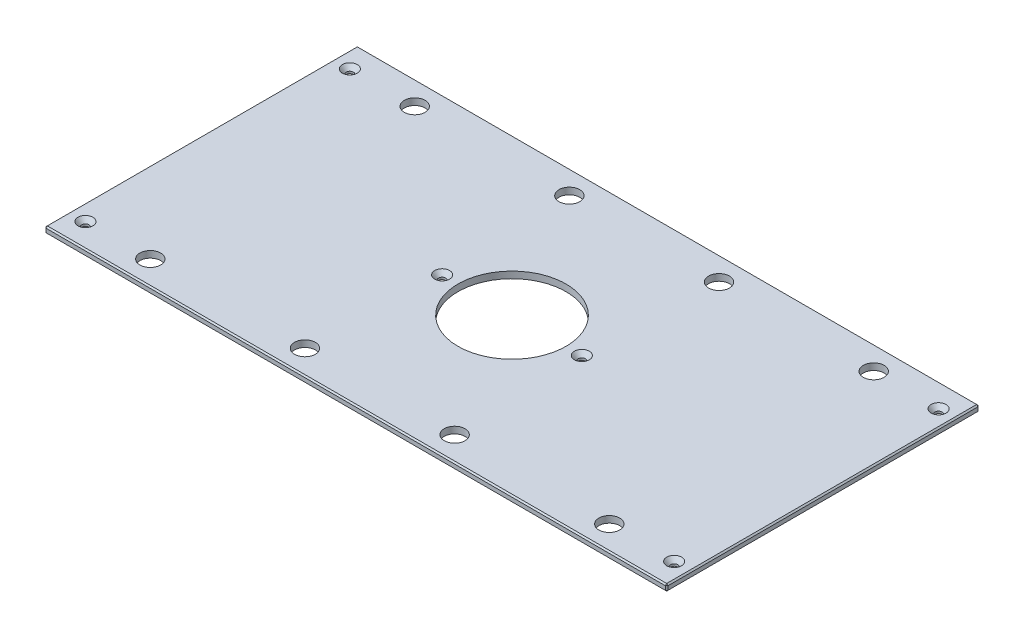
from build123d import *

# Parameters (mm, degrees)
SKETCH1_W                                     = 593.725
SKETCH1_H                                     = 298.45
BOSS_EXTRUDE1_DEPTH                           = 6.35
SKETCH13_R                                    = 51.562
CUT_EXTRUDE6_DEPTH                            = 333.318773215
F_25_32_0_78125_DIAMETER_HOLE1_D              = 19.84375
CHAMFER2_SIZE                                 = 1.27
CSK_FOR_1_4_FLAT_HEAD_MACHINE_SCREW1_AT_COUNT = 2
CSK_FOR_1_4_FLAT_HEAD_MACHINE_SCREW1_AT_PITCH = 252.40996
CSK_FOR_1_4_FLAT_HEAD_MACHINE_SCREW1_2_COUNT  = 2
CSK_FOR_1_4_FLAT_HEAD_MACHINE_SCREW1_2_PITCH  = 616.057374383
CSK_FOR_1_4_FLAT_HEAD_MACHINE_SCREW1_3_COUNT  = 2
CSK_FOR_1_4_FLAT_HEAD_MACHINE_SCREW1_3_PITCH  = 369.860664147
CSK_FOR_1_4_FLAT_HEAD_MACHINE_SCREW1_4_COUNT  = 2
CSK_FOR_1_4_FLAT_HEAD_MACHINE_SCREW1_4_PITCH  = 248.711770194
CSK_FOR_1_4_FLAT_HEAD_MACHINE_SCREW1_5_COUNT  = 2
CSK_FOR_1_4_FLAT_HEAD_MACHINE_SCREW1_5_PITCH  = 561.975
CSK_FOR_1_4_FLAT_HEAD_MACHINE_SCREW1_6_COUNT  = 2
CSK_FOR_1_4_FLAT_HEAD_MACHINE_SCREW1_6_PITCH  = 500.0625
CSK_FOR_1_4_FLAT_HEAD_MACHINE_SCREW1_7_COUNT  = 2
CSK_FOR_1_4_FLAT_HEAD_MACHINE_SCREW1_7_PITCH  = 560.154703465


with BuildPart() as part:
    # Sketch1 → Boss-Extrude1 (new body)
    with BuildSketch(Plane(origin=(0, 0, 0), x_dir=(1, 0, 0), z_dir=(0, 1, 0))):
        Rectangle(SKETCH1_W, SKETCH1_H)
    extrude(amount=BOSS_EXTRUDE1_DEPTH)

    # Sketch13 → Cut-Extrude6 (cut, through all)
    with BuildSketch(Plane(origin=(0, 6.35, 0), x_dir=(1, 0, 0), z_dir=(0, 1, 0))):
        with Locations(Location((0, 0, 0), (0, 0, 270))):
            Circle(SKETCH13_R)
    extrude(amount=-CUT_EXTRUDE6_DEPTH, mode=Mode.SUBTRACT)

    # 25_32 _0.78125_ Diameter Hole1 (through all)
    with Locations(Plane(origin=(0, 6.35, 0), x_dir=(1, 0, 0), z_dir=(0, 1, 0))):
        with Locations((219.075, 126.20498), (-219.075, 126.20498), (219.075, -126.20498), (-219.075, -126.20498), (-71.4375, 126.20498), (71.4375, 126.20498), (71.4375, -126.20498), (-71.4375, -126.20498)):
            Hole(F_25_32_0_78125_DIAMETER_HOLE1_D / 2)

    # Chamfer2
    chamfer2_edges = [part.edges().sort_by_distance(p)[0] for p in [
        (296.8625, 6.35, 0),
        (0, 6.35, -149.225),
        (-296.8625, 6.35, 0),
        (0, 0, -149.225),
        (296.8625, 0, 0),
        (0, 0, 149.225),
        (-296.8625, 0, 0),
        (0, 6.35, 149.225),
        (-296.8625, 3.175, -149.225),
        (296.8625, 3.175, -149.225),
        (296.8625, 3.175, 149.225),
        (-296.8625, 3.175, 149.225),
    ]]
    chamfer(chamfer2_edges, length=CHAMFER2_SIZE)

    # Sketch24 → CSK for 1_4 Flat Head Machine Screw1 (revolve, cut)
    with BuildSketch(Plane(origin=(280.9875, 6.35, -126.20498), x_dir=(0, 0, 1), z_dir=(1, 0, 0))):
        Polygon((0, 0), (0, 6.35), (3.3782, 6.35), (3.3782, 4.324464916), (7.1374, 0), align=None)
    csk_for_1_4_flat_head_machine_screw1 = revolve(axis=Axis((280.9875, 12.7, -126.20498), (0, -1, 0)), mode=Mode.SUBTRACT)

    # CSK for 1_4 Flat Head Machine Screw1 at: CSK for 1_4 Flat Head Machine Screw1 ×2
    with Locations(*[(0, 0, i * CSK_FOR_1_4_FLAT_HEAD_MACHINE_SCREW1_AT_PITCH) for i in range(1, CSK_FOR_1_4_FLAT_HEAD_MACHINE_SCREW1_AT_COUNT)]):
        add(csk_for_1_4_flat_head_machine_screw1, mode=Mode.SUBTRACT)

    # CSK for 1_4 Flat Head Machine Screw1 2: CSK for 1_4 Flat Head Machine Screw1 ×2
    with Locations(*[Vector(-0.9122121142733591, 0, 0.40971826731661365) * (i * CSK_FOR_1_4_FLAT_HEAD_MACHINE_SCREW1_2_PITCH) for i in range(1, CSK_FOR_1_4_FLAT_HEAD_MACHINE_SCREW1_2_COUNT)]):
        add(csk_for_1_4_flat_head_machine_screw1, mode=Mode.SUBTRACT)

    # CSK for 1_4 Flat Head Machine Screw1 3: CSK for 1_4 Flat Head Machine Screw1 ×2
    with Locations(*[Vector(-0.9399823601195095, 0, 0.341223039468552) * (i * CSK_FOR_1_4_FLAT_HEAD_MACHINE_SCREW1_3_PITCH) for i in range(1, CSK_FOR_1_4_FLAT_HEAD_MACHINE_SCREW1_3_COUNT)]):
        add(csk_for_1_4_flat_head_machine_screw1, mode=Mode.SUBTRACT)

    # CSK for 1_4 Flat Head Machine Screw1 4: CSK for 1_4 Flat Head Machine Screw1 ×2
    with Locations(*[Vector(-0.8616902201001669, 0, 0.5074346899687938) * (i * CSK_FOR_1_4_FLAT_HEAD_MACHINE_SCREW1_4_PITCH) for i in range(1, CSK_FOR_1_4_FLAT_HEAD_MACHINE_SCREW1_4_COUNT)]):
        add(csk_for_1_4_flat_head_machine_screw1, mode=Mode.SUBTRACT)

    # CSK for 1_4 Flat Head Machine Screw1 5: CSK for 1_4 Flat Head Machine Screw1 ×2
    with Locations(*[(-i * CSK_FOR_1_4_FLAT_HEAD_MACHINE_SCREW1_5_PITCH, 0, 0) for i in range(1, CSK_FOR_1_4_FLAT_HEAD_MACHINE_SCREW1_5_COUNT)]):
        add(csk_for_1_4_flat_head_machine_screw1, mode=Mode.SUBTRACT)

    # CSK for 1_4 Flat Head Machine Screw1 6: CSK for 1_4 Flat Head Machine Screw1 ×2
    with Locations(*[(-i * CSK_FOR_1_4_FLAT_HEAD_MACHINE_SCREW1_6_PITCH, 0, 0) for i in range(1, CSK_FOR_1_4_FLAT_HEAD_MACHINE_SCREW1_6_COUNT)]):
        add(csk_for_1_4_flat_head_machine_screw1, mode=Mode.SUBTRACT)

    # CSK for 1_4 Flat Head Machine Screw1 7: CSK for 1_4 Flat Head Machine Screw1 ×2
    with Locations(*[Vector(-0.892722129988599, 0, 0.45060758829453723) * (i * CSK_FOR_1_4_FLAT_HEAD_MACHINE_SCREW1_7_PITCH) for i in range(1, CSK_FOR_1_4_FLAT_HEAD_MACHINE_SCREW1_7_COUNT)]):
        add(csk_for_1_4_flat_head_machine_screw1, mode=Mode.SUBTRACT)


solid = part.part
